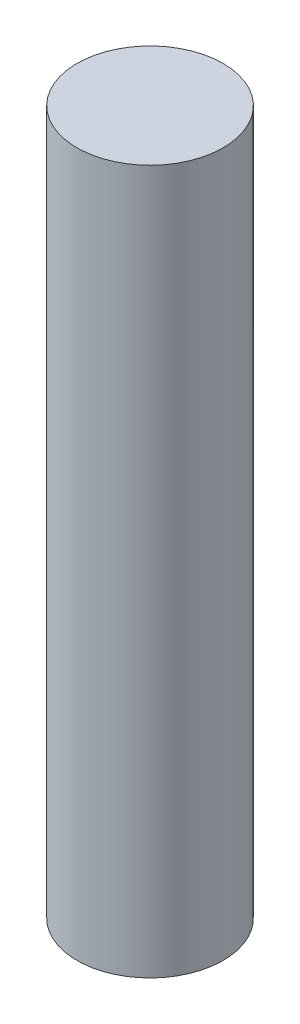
from build123d import *

# Parameters (mm, degrees)
SCHIZZO1_R                   = 1.35
ESTRUSIONE_ESTRUSIONE1_DEPTH = 13


with BuildPart() as part:
    # Schizzo1 → Estrusione-Estrusione1 (new body)
    with BuildSketch(Plane(origin=(0, 0, 0), x_dir=(1, 0, 0), z_dir=(0, 1, 0))):
        with Locations(Location((0, 0, 0), (0, 0, 90))):
            Circle(SCHIZZO1_R)
    extrude(amount=ESTRUSIONE_ESTRUSIONE1_DEPTH)


solid = part.part
